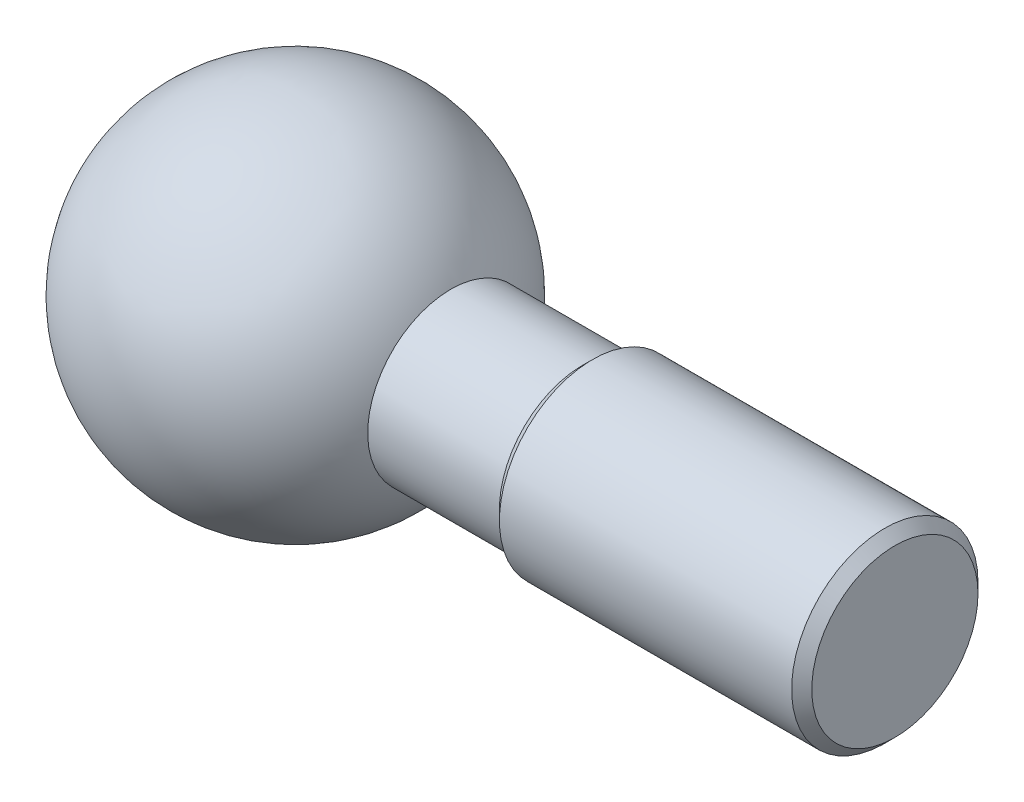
from build123d import *


with BuildPart() as part:
    # Esquisse1 → R_volution1 (revolve)
    with BuildSketch(Plane.XY, mode=Mode.PRIVATE) as r_volution1_sk:
        with BuildLine():
            Line((-32.685276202, 2.65), (-32.685276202, 1))
            Line((-32.685276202, 1), (-32.885276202, 0.8))
            Line((-32.885276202, 0.8), (-38.685276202, 0.8))
            Line((-38.685276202, 0.8), (-38.885276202, 1))
            Line((-38.885276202, 1), (-41.5, 1))
            ThreePointArc((-41.5, 1), (-45.437156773, -0.745094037), (-48.086664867, 2.65))
            Line((-48.086664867, 2.65), (-32.685276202, 2.65))
        make_face()
    revolve(r_volution1_sk.sketch.rotate(Axis((-29.5, 2.65, 0), (-1, 0, 0)), 270), axis=Axis((-29.5, 2.65, 0), (-1, 0, 0)))


solid = part.part
